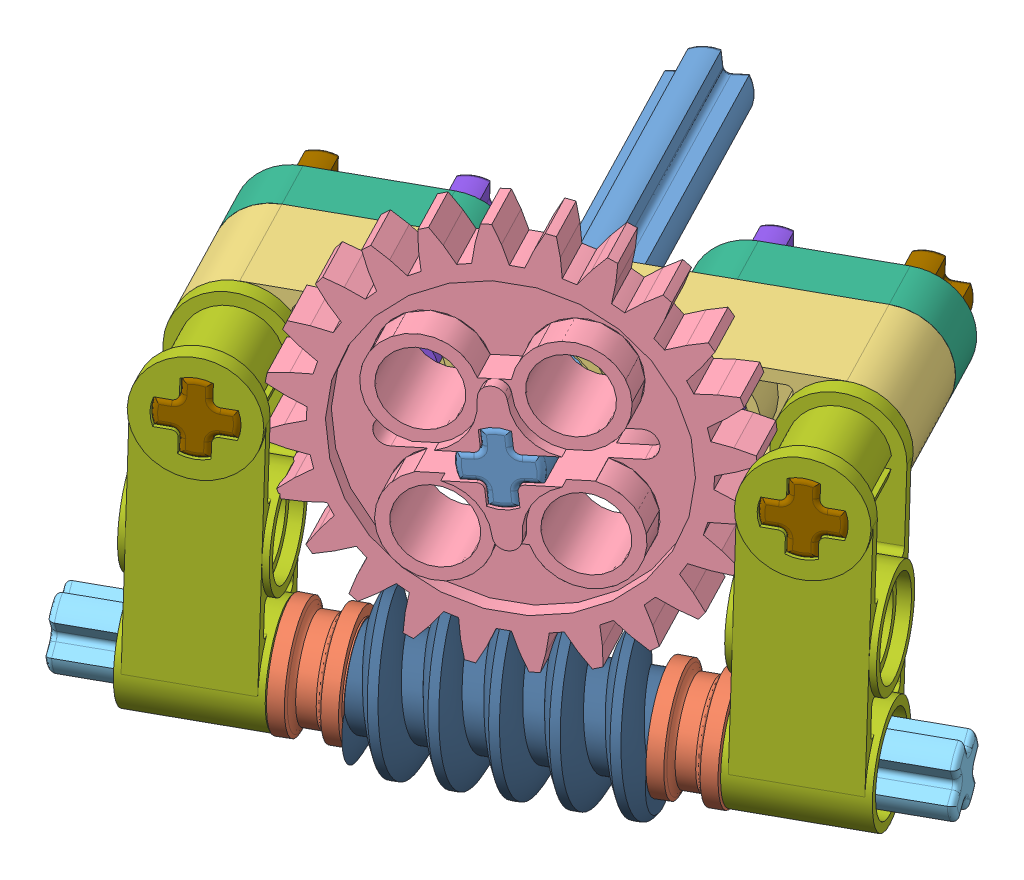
SolidWorks assembly Assem1.sldasm, configuration Default (file format 12000). Lengths in mm.
Overall size (49.01 37.85 48.27).
15 component instances, 10 part files, 41 mates.
Components (placement in the parent):
- 32073 Axle 5-1: 32073 Axle 5.SLDPRT [Default] at (-63.8434 22.8847 46.9133) x (0.145115 -0.989348 0.011532) z (-0.860053 -0.120371 0.495802) size (4.8 40 4.8)
- 32123 Bush 0.5 Smooth-1: 32123 Bush 0.5 Smooth.SLDPRT [Default] at (-54.3661 9.9286 84.2539) x (0.871448 -0.004283 -0.490469) z (0.42594 -0.489238 0.761066) size (4 7.44 7.44)
- 32316 Beam 5-1: 32316 Beam 5.SLDPRT [Default] at (-66.0474 24.9181 75.6014) x (0.871448 -0.004283 -0.490469) z (0.036434 -0.996634 0.073438) size (39.2 8 7.2)
- 3648 Gear 24-1: 3648 Gear 24.SLDPRT [Default] at (-46.2346 25.8319 78.1742) x (-0.860053 -0.120371 0.495802) z (-0.145115 0.989348 -0.011532) size (26.1 8 26.1)
- 3706 Axle 6 Black-1: 3706 Axle 6 Black.SLDPRT [Default] at (-24.7369 9.783 67.5779) x (0.243215 0.87214 0.424521) z (0.42594 -0.489238 0.761066) size (4.8 48 4.8)
- 41677 Liftarm 1 x 2 Thin Red-1: 41677 Liftarm 1 x 2 Thin Red.SLDPRT [Default] at (-42.6251 24.6344 60.1315) x (0.871448 -0.004283 -0.490469) z (0.036434 -0.996634 0.073438) size (15.2 4 7.2)
- 42003 Axle and Pin Connector Perpendicular 3L with 2 Pin Holes Gray-1: 42003 Axle and Pin Connector Perpendicular 3L with 2 Pin Holes Gray.SLDPRT [Default] at (-60.1778 25.9005 86.0217) x (-0.036434 0.996634 -0.073438) z (-0.871448 0.004283 0.490469) size (23.2 8 8)
- 43093 Axle Pin with Friction Ridges Lengthwise-1: 43093 Axle Pin with Friction Ridges Lengthwise.SLDPRT [Default] at (-45.1326 24.8153 63.8301) x (0.871448 -0.004283 -0.490469) z (-0.036434 0.996634 -0.073438) size (6 16 6)
- 4519 Axle 3-1: 4519 Axle 3.SLDPRT [Default] at (-69.9604 24.2631 68.6545) x (0.036434 -0.996634 0.073438) z (-0.871448 0.004283 0.490469) size (4.8 24 4.8)
- 4716 Gear Worm Screw, Long Black-1: 4716 Gear Worm Screw, Long Black.SLDPRT [Default] at (-45.6516 9.8858 79.3492) x (0.871448 -0.004283 -0.490469) z (-0.243215 -0.87214 -0.424521) size (19.12 10.01 10.28)
- 41677 Liftarm 1 x 2 Thin Red-2: 41677 Liftarm 1 x 2 Thin Red.SLDPRT [Default] at (-63.5398 24.7372 71.9028) x (0.871448 -0.004283 -0.490469) z (0.036434 -0.996634 0.073438) size (15.2 4 7.2)
- 4519 Axle 3-2: 4519 Axle 3.SLDPRT [Default] at (-42.0741 24.1261 52.9595) x (-0.036434 0.996634 -0.073438) z (0.871448 -0.004283 -0.490469) size (4.8 24 4.8)
- 42003 Axle and Pin Connector Perpendicular 3L with 2 Pin Holes Gray-2: 42003 Axle and Pin Connector Perpendicular 3L with 2 Pin Holes Gray.SLDPRT [Default] at (-32.2914 25.7634 70.3267) x (-0.036434 0.996634 -0.073438) z (-0.871448 0.004283 0.490469) size (23.2 8 8)
- 32123 Bush 0.5 Smooth-2: 32123 Bush 0.5 Smooth.SLDPRT [Default] at (-36.9372 9.843 74.4445) x (0.871448 -0.004283 -0.490469) z (-0.42594 0.489238 -0.761066) size (4 7.44 7.44)
- 43093 Axle Pin with Friction Ridges Lengthwise-2: 43093 Axle Pin with Friction Ridges Lengthwise.SLDPRT [Default] at (-59.0758 24.8838 71.6776) x (0.871448 -0.004283 -0.490469) z (-0.036434 0.996634 -0.073438) size (6 16 6)
Mates (geometry in assembly coordinates):
- Concentric1: concentric aligned: cylinder of 42003 Axle and Pin Connector Perpendicular 3L with 2 Pin Holes Gray-1 through (-56.109 9.9372 85.2348) axis (-0.871448 0.004283 0.490469) radius 2.4; cylinder of 42003 Axle and Pin Connector Perpendicular 3L with 2 Pin Holes Gray-2 through (-28.2227 9.8001 69.5398) axis (-0.871448 0.004283 0.490469) radius 2.4
- Concentric2: concentric aligned: cylinder of 42003 Axle and Pin Connector Perpendicular 3L with 2 Pin Holes Gray-1 through (-56.4005 17.9103 84.6473) axis (-0.871448 0.004283 0.490469) radius 2.4; cylinder of 42003 Axle and Pin Connector Perpendicular 3L with 2 Pin Holes Gray-2 through (-28.5142 17.7732 68.9523) axis (-0.871448 0.004283 0.490469) radius 2.4
- Concentric3: concentric aligned: cylinder of 42003 Axle and Pin Connector Perpendicular 3L with 2 Pin Holes Gray-1 through (-58.2212 26.2279 89.4951) axis (-0.489133 -0.081867 -0.868359) radius 2.4; cylinder of 4519 Axle 3-1 through (-58.2212 26.2279 89.4951) axis (-0.489133 -0.081867 -0.868359) radius 2.4
- Coincident1: coincident anti-aligned: plane of 42003 Axle and Pin Connector Perpendicular 3L with 2 Pin Holes Gray-1 through (-59.3046 25.3564 90.1875) normal (-0.036434 0.996634 -0.073438); plane of 4519 Axle 3-1 through (-57.4223 25.3471 89.1281) normal (0.036434 -0.996634 0.073438)
- Coincident2: coincident aligned: plane of 42003 Axle and Pin Connector Perpendicular 3L with 2 Pin Holes Gray-1 through (-58.2212 26.2279 89.4951) normal (0.489133 0.081867 0.868359); plane of 4519 Axle 3-1 through (-58.2212 26.2279 89.4951) normal (0.489133 0.081867 0.868359)
- Concentric4: concentric aligned: cylinder of 4519 Axle 3-2 through (-30.3349 26.0909 73.8001) axis (-0.489133 -0.081867 -0.868359) radius 2.4; cylinder of 42003 Axle and Pin Connector Perpendicular 3L with 2 Pin Holes Gray-2 through (-30.3349 26.0909 73.8001) axis (-0.489133 -0.081867 -0.868359) radius 2.4
- Coincident3: coincident anti-aligned: plane of 4519 Axle 3-2 through (-32.2486 25.2234 74.9599) normal (0.036434 -0.996634 0.073438); plane of 42003 Axle and Pin Connector Perpendicular 3L with 2 Pin Holes Gray-2 through (-28.357 25.2043 72.7696) normal (-0.036434 0.996634 -0.073438)
- Coincident4: coincident aligned: plane of 4519 Axle 3-2 through (-30.3349 26.0909 73.8001) normal (0.489133 0.081867 0.868359); plane of 42003 Axle and Pin Connector Perpendicular 3L with 2 Pin Holes Gray-2 through (-30.3349 26.0909 73.8001) normal (0.489133 0.081867 0.868359)
- Concentric5: concentric anti-aligned: cylinder of 3706 Axle 6 Black-1 through (-66.5664 9.9886 91.1204) axis (0.871448 -0.004283 -0.490469) radius 2.4; cylinder of 42003 Axle and Pin Connector Perpendicular 3L with 2 Pin Holes Gray-1 through (-56.109 9.9372 85.2348) axis (-0.871448 0.004283 0.490469) radius 2.4
- Concentric6: concentric aligned: cylinder of 32123 Bush 0.5 Smooth-1 through (-56.1232 9.9373 85.2428) axis (0.871448 -0.004283 -0.490469) radius 2.4; cylinder of 3706 Axle 6 Black-1 through (-66.5664 9.9886 91.1204) axis (0.871448 -0.004283 -0.490469) radius 2.4
- Coincident5: coincident anti-aligned: plane of 32123 Bush 0.5 Smooth-1 through (-56.1938 11.4827 85.1038) normal (0.428203 -0.481032 0.765016); plane of 3706 Axle 6 Black-1 through (-67.1537 9.6404 90.0799) normal (-0.428203 0.481032 -0.765016)
- Concentric7: concentric aligned: cylinder of 3706 Axle 6 Black-1 through (-66.5664 9.9886 91.1204) axis (0.871448 -0.004283 -0.490469) radius 2.4; cylinder of 32123 Bush 0.5 Smooth-2 through (-38.6942 9.8516 75.4334) axis (0.871448 -0.004283 -0.490469) radius 2.4
- Coincident6: coincident anti-aligned: plane of 3706 Axle 6 Black-1 through (-66.7237 7.6078 90.8617) normal (0.428203 -0.481032 0.765016); plane of 32123 Bush 0.5 Smooth-2 through (-38.6236 8.3061 75.5724) normal (-0.428203 0.481032 -0.765016)
- Coincident7: coincident anti-aligned: plane of 32123 Bush 0.5 Smooth-1 through (-56.109 9.9372 85.2348) normal (-0.871448 0.004283 0.490469); plane of 42003 Axle and Pin Connector Perpendicular 3L with 2 Pin Holes Gray-1 through (-56.4005 17.9103 84.6473) normal (0.871448 -0.004283 -0.490469)
- Coincident8: coincident anti-aligned: plane of 42003 Axle and Pin Connector Perpendicular 3L with 2 Pin Holes Gray-2 through (-35.4857 17.8075 72.876) normal (-0.871448 0.004283 0.490469); plane of 32123 Bush 0.5 Smooth-2 through (-35.1943 9.8344 73.4635) normal (0.871448 -0.004283 -0.490469)
- Concentric8: concentric aligned: cylinder of 3706 Axle 6 Black-1 through (-66.5664 9.9886 91.1204) axis (0.871448 -0.004283 -0.490469) radius 2.4; cylinder of 4716 Gear Worm Screw, Long Black-1 through (-52.6232 9.9201 83.2729) axis (0.871448 -0.004283 -0.490469) radius 2.4
- Coincident9: coincident anti-aligned: plane of 3706 Axle 6 Black-1 through (-65.8208 8.143 92.4613) normal (-0.239208 -0.876692 -0.417361); plane of 4716 Gear Worm Screw, Long Black-1 through (-51.8776 8.0745 84.6138) normal (0.239208 0.876692 0.417361)
- Coincident10: coincident anti-aligned: plane of 4716 Gear Worm Screw, Long Black-1 through (-38.6801 9.8515 75.4254) normal (0.871448 -0.004283 -0.490469); plane of 32123 Bush 0.5 Smooth-2 through (-38.6801 9.8515 75.4254) normal (-0.871448 0.004283 0.490469)
- Coincident11: coincident anti-aligned: plane of 32123 Bush 0.5 Smooth-1 through (-52.6232 9.9201 83.2729) normal (0.871448 -0.004283 -0.490469); plane of 4716 Gear Worm Screw, Long Black-1 through (-52.6232 9.9201 83.2729) normal (-0.871448 0.004283 0.490469)
- Concentric9: concentric anti-aligned: cylinder of 41677 Liftarm 1 x 2 Thin Red-1 through (-40.1175 24.4535 56.4329) axis (0.489133 0.081867 0.868359) radius 2.4; cylinder of 4519 Axle 3-2 through (-30.3349 26.0909 73.8001) axis (-0.489133 -0.081867 -0.868359) radius 2.4
- Coincident12: coincident anti-aligned: plane of 41677 Liftarm 1 x 2 Thin Red-1 through (-38.2038 25.321 55.2732) normal (0.036434 -0.996634 0.073438); plane of 4519 Axle 3-2 through (-28.4211 26.9583 72.6403) normal (-0.036434 0.996634 -0.073438)
- Concentric10: concentric anti-aligned: cylinder of 4519 Axle 3-1 through (-58.2212 26.2279 89.4951) axis (-0.489133 -0.081867 -0.868359) radius 2.4; cylinder of 41677 Liftarm 1 x 2 Thin Red-2 through (-68.0039 24.5906 72.1279) axis (0.489133 0.081867 0.868359) radius 2.4
- Coincident13: coincident anti-aligned: plane of 4519 Axle 3-1 through (-59.0202 27.1087 89.8621) normal (-0.036434 0.996634 -0.073438); plane of 41677 Liftarm 1 x 2 Thin Red-2 through (-69.1514 25.4731 72.6911) normal (0.036434 -0.996634 0.073438)
- Concentric11: concentric aligned: cylinder of 32316 Beam 5-1 through (-34.248 25.4359 66.8532) axis (-0.489133 -0.081867 -0.868359) radius 2.4; cylinder of 4519 Axle 3-2 through (-30.3349 26.0909 73.8001) axis (-0.489133 -0.081867 -0.868359) radius 2.4
- Concentric12: concentric aligned: cylinder of 32316 Beam 5-1 through (-62.1343 25.573 82.5482) axis (-0.489133 -0.081867 -0.868359) radius 2.4; cylinder of 4519 Axle 3-1 through (-58.2212 26.2279 89.4951) axis (-0.489133 -0.081867 -0.868359) radius 2.4
- Coincident14: coincident anti-aligned: plane of 32316 Beam 5-1 through (-62.1343 25.573 82.5482) normal (0.489133 0.081867 0.868359); plane of 42003 Axle and Pin Connector Perpendicular 3L with 2 Pin Holes Gray-1 through (-62.1343 25.573 82.5482) normal (-0.489133 -0.081867 -0.868359)
- Coincident15: coincident anti-aligned: plane of 32316 Beam 5-1 through (-66.0474 24.9181 75.6014) normal (-0.489133 -0.081867 -0.868359); plane of 41677 Liftarm 1 x 2 Thin Red-1 through (-45.1326 24.8153 63.8301) normal (0.489133 0.081867 0.868359)
- Coincident16: coincident anti-aligned: plane of 32316 Beam 5-1 through (-66.0474 24.9181 75.6014) normal (-0.489133 -0.081867 -0.868359); plane of 41677 Liftarm 1 x 2 Thin Red-2 through (-66.0474 24.9181 75.6014) normal (0.489133 0.081867 0.868359)
- Concentric13: concentric aligned: cylinder of 32316 Beam 5-1 through (-41.2195 25.4702 70.777) axis (-0.489133 -0.081867 -0.868359) radius 2.4; cylinder of 43093 Axle Pin with Friction Ridges Lengthwise-1 through (-41.2195 25.4702 70.777) axis (-0.489133 -0.081867 -0.868359) radius 2.4
- Concentric14: concentric aligned: cylinder of 32316 Beam 5-1 through (-55.1627 25.5387 78.6245) axis (-0.489133 -0.081867 -0.868359) radius 2.4; cylinder of 43093 Axle Pin with Friction Ridges Lengthwise-2 through (-55.1627 25.5387 78.6245) axis (-0.489133 -0.081867 -0.868359) radius 2.4
- Coincident17: coincident anti-aligned: plane of 41677 Liftarm 1 x 2 Thin Red-2 through (-59.8848 23.6738 67.641) normal (-0.036434 0.996634 -0.073438); plane of 43093 Axle Pin with Friction Ridges Lengthwise-2 through (-64.0722 23.3573 65.4232) normal (0.036434 -0.996634 0.073438)
- Coincident19: coincident aligned: plane of 32316 Beam 5-1 through (-62.1343 25.573 82.5482) normal (0.489133 0.081867 0.868359); plane of 43093 Axle Pin with Friction Ridges Lengthwise-2 through (-55.1627 25.5387 78.6245) normal (0.489133 0.081867 0.868359)
- Coincident20: coincident anti-aligned: plane of 41677 Liftarm 1 x 2 Thin Red-1 through (-47.9374 26.7169 60.6243) normal (0.871448 -0.004283 -0.490469); plane of 43093 Axle Pin with Friction Ridges Lengthwise-1 through (-49.7312 21.9388 57.4788) normal (-0.871448 0.004283 0.490469)
- Coincident21: coincident aligned: plane of 32316 Beam 5-1 through (-62.1343 25.573 82.5482) normal (0.489133 0.081867 0.868359); plane of 43093 Axle Pin with Friction Ridges Lengthwise-1 through (-41.2195 25.4702 70.777) normal (0.489133 0.081867 0.868359)
- Concentric15: concentric aligned: cylinder of 32073 Axle 5-1 through (-44.2781 26.1594 81.6476) axis (-0.489133 -0.081867 -0.868359) radius 2.4; cylinder of 32316 Beam 5-1 through (-48.1911 25.5045 74.7007) axis (-0.489133 -0.081867 -0.868359) radius 2.4
- Concentric16: concentric anti-aligned: cylinder of 32073 Axle 5-1 through (-44.2781 26.1594 81.6476) axis (-0.489133 -0.081867 -0.868359) radius 2.4; cylinder of 3648 Gear 24-1 through (-48.1911 25.5045 74.7007) axis (0.489133 0.081867 0.868359) radius 2.4
- Coincident22: coincident anti-aligned: plane of 32073 Axle 5-1 through (-45.1166 26.9904 82.0416) normal (-0.86808 -0.051065 0.49379); plane of 3648 Gear 24-1 through (-49.0635 26.7336 75.0763) normal (0.86808 0.051065 -0.49379)
- Coincident23: coincident aligned: plane of 32073 Axle 5-1 through (-44.2781 26.1594 81.6476) normal (0.489133 0.081867 0.868359); plane of 3648 Gear 24-1 through (-44.6477 30.1204 81.4824) normal (0.489133 0.081867 0.868359)
- Coincident24: coincident anti-aligned: plane of 32316 Beam 5-1 through (-62.1343 25.573 82.5482) normal (0.489133 0.081867 0.868359); plane of 3648 Gear 24-1 through (-48.5608 29.4655 74.5355) normal (-0.489133 -0.081867 -0.868359)
- GearMate1: gear = 21.5 mm: circle of 32123 Bush 0.5 Smooth-2; circle of 3648 Gear 24-1
- Distance1: distance = 4 mm aligned: plane of 3706 Axle 6 Black-1 through (-24.7369 9.783 67.5779) normal (0.871448 -0.004283 -0.490469); plane of 42003 Axle and Pin Connector Perpendicular 3L with 2 Pin Holes Gray-2 through (-28.5142 17.7732 68.9523) normal (0.871448 -0.004283 -0.490469)
